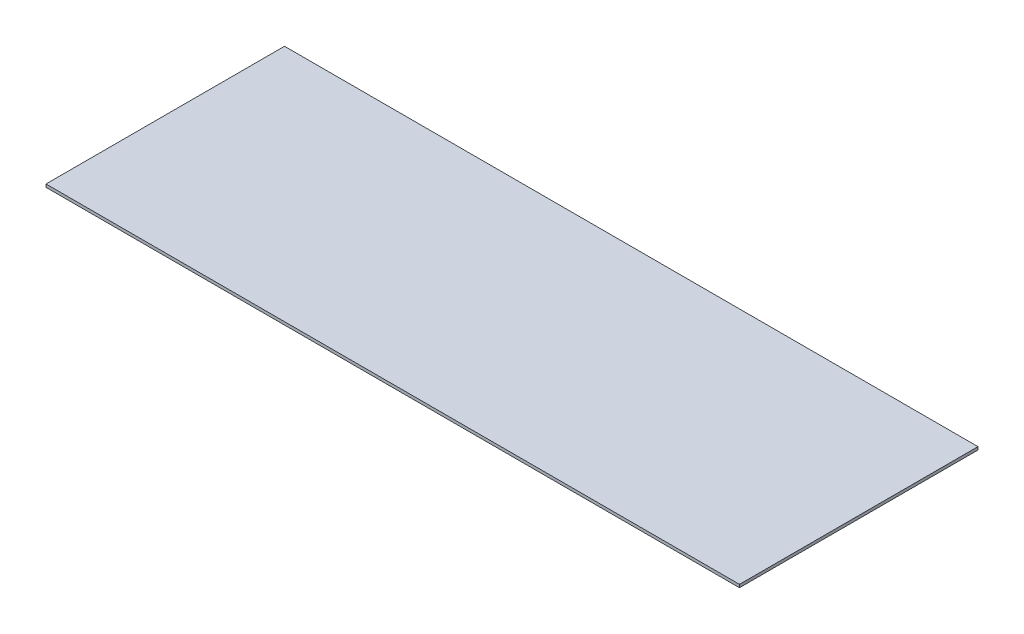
from build123d import *

# Parameters (mm, degrees)
SKETCH1_W           = 942
SKETCH1_H           = 324
BOSS_EXTRUDE1_DEPTH = 4


with BuildPart() as part:
    # Sketch1 → Boss-Extrude1 (new body)
    with BuildSketch(Plane(origin=(0, 0, 0), x_dir=(1, 0, 0), z_dir=(0, 1, 0))):
        with Locations((0, 162)):
            Rectangle(SKETCH1_W, SKETCH1_H)
    extrude(amount=BOSS_EXTRUDE1_DEPTH)


solid = part.part
